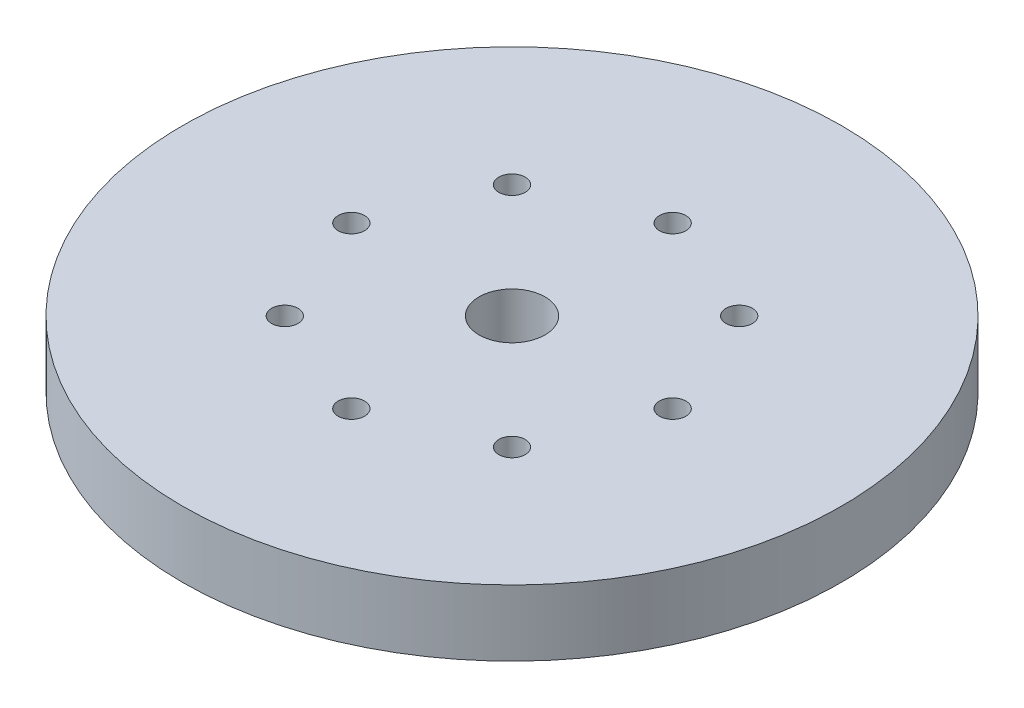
ISO-10303-21;
HEADER;
FILE_DESCRIPTION(('STEP AP214'),'2;1');
FILE_NAME('part.step','',(''),(''),'','','');
FILE_SCHEMA(('AUTOMOTIVE_DESIGN { 1 0 10303 214 1 1 1 1 }'));
ENDSEC;
DATA;
#1=APPLICATION_CONTEXT('core data for automotive mechanical design processes');
#2=APPLICATION_PROTOCOL_DEFINITION('international standard','automotive_design',2000,#1);
#3=PRODUCT_CONTEXT('',#1,'mechanical');
#4=PRODUCT('Part','Part','',(#3));
#5=PRODUCT_RELATED_PRODUCT_CATEGORY('part','',(#4));
#6=PRODUCT_DEFINITION_FORMATION('','',#4);
#7=PRODUCT_DEFINITION_CONTEXT('part definition',#1,'design');
#8=PRODUCT_DEFINITION('design','',#6,#7);
#9=PRODUCT_DEFINITION_SHAPE('','',#8);
#10=(LENGTH_UNIT() NAMED_UNIT(*) SI_UNIT(.MILLI.,.METRE.));
#11=(NAMED_UNIT(*) PLANE_ANGLE_UNIT() SI_UNIT($,.RADIAN.));
#12=(NAMED_UNIT(*) SI_UNIT($,.STERADIAN.) SOLID_ANGLE_UNIT());
#13=UNCERTAINTY_MEASURE_WITH_UNIT(LENGTH_MEASURE(1.E-05),#10,'distance_accuracy_value','');
#14=(GEOMETRIC_REPRESENTATION_CONTEXT(3) GLOBAL_UNCERTAINTY_ASSIGNED_CONTEXT((#13)) GLOBAL_UNIT_ASSIGNED_CONTEXT((#10,
#11,#12)) REPRESENTATION_CONTEXT('',''));
#15=CARTESIAN_POINT('',(0.,0.,0.));
#16=DIRECTION('',(0.,0.,1.));
#17=DIRECTION('',(1.,0.,0.));
#18=AXIS2_PLACEMENT_3D('',#15,#16,#17);
#19=CARTESIAN_POINT('',(0.,6.,0.));
#20=DIRECTION('',(0.,1.,0.));
#21=DIRECTION('',(0.,0.,1.));
#22=AXIS2_PLACEMENT_3D('',#19,#20,#21);
#23=PLANE('',#22);
#24=CARTESIAN_POINT('',(-10.3237590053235,6.,-10.3237590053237));
#25=DIRECTION('',(0.,1.,0.));
#26=DIRECTION('',(0.707106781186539,0.,0.707106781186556));
#27=AXIS2_PLACEMENT_3D('',#24,#25,#26);
#28=CIRCLE('',#27,1.2);
#29=CARTESIAN_POINT('',(-9.47523086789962,6.,-9.47523086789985));
#30=VERTEX_POINT('',#29);
#31=EDGE_CURVE('E415',#30,#30,#28,.T.);
#32=ORIENTED_EDGE('',*,*,#31,.F.);
#33=EDGE_LOOP('',(#32));
#34=FACE_BOUND('',#33,.T.);
#35=CARTESIAN_POINT('',(-14.6,6.,-1.52926971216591E-13));
#36=DIRECTION('',(0.,1.,0.));
#37=DIRECTION('',(1.,0.,0.));
#38=AXIS2_PLACEMENT_3D('',#35,#36,#37);
#39=CIRCLE('',#38,1.2);
#40=CARTESIAN_POINT('',(-13.4,6.,-1.40357631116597E-13));
#41=VERTEX_POINT('',#40);
#42=EDGE_CURVE('E409',#41,#41,#39,.T.);
#43=ORIENTED_EDGE('',*,*,#42,.F.);
#44=EDGE_LOOP('',(#43));
#45=FACE_BOUND('',#44,.T.);
#46=CARTESIAN_POINT('',(-10.3237590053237,6.,10.3237590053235));
#47=DIRECTION('',(0.,1.,0.));
#48=DIRECTION('',(0.707106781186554,0.,-0.707106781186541));
#49=AXIS2_PLACEMENT_3D('',#46,#47,#48);
#50=CIRCLE('',#49,1.2);
#51=CARTESIAN_POINT('',(-9.47523086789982,6.,9.47523086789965));
#52=VERTEX_POINT('',#51);
#53=EDGE_CURVE('E403',#52,#52,#50,.T.);
#54=ORIENTED_EDGE('',*,*,#53,.F.);
#55=EDGE_LOOP('',(#54));
#56=FACE_BOUND('',#55,.T.);
#57=CARTESIAN_POINT('',(-1.01951314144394E-13,6.,14.6));
#58=DIRECTION('',(0.,1.,0.));
#59=DIRECTION('',(0.,0.,-1.));
#60=AXIS2_PLACEMENT_3D('',#57,#58,#59);
#61=CIRCLE('',#60,1.2);
#62=CARTESIAN_POINT('',(0.,6.,13.4));
#63=VERTEX_POINT('',#62);
#64=EDGE_CURVE('E397',#63,#63,#61,.T.);
#65=ORIENTED_EDGE('',*,*,#64,.F.);
#66=EDGE_LOOP('',(#65));
#67=FACE_BOUND('',#66,.T.);
#68=CARTESIAN_POINT('',(10.3237590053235,6.,10.3237590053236));
#69=DIRECTION('',(0.,1.,0.));
#70=DIRECTION('',(-0.707106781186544,0.,-0.707106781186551));
#71=AXIS2_PLACEMENT_3D('',#68,#69,#70);
#72=CIRCLE('',#71,1.2);
#73=CARTESIAN_POINT('',(9.47523086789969,6.,9.47523086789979));
#74=VERTEX_POINT('',#73);
#75=EDGE_CURVE('E391',#74,#74,#72,.T.);
#76=ORIENTED_EDGE('',*,*,#75,.F.);
#77=EDGE_LOOP('',(#76));
#78=FACE_BOUND('',#77,.T.);
#79=CARTESIAN_POINT('',(14.6,6.,0.));
#80=DIRECTION('',(0.,1.,0.));
#81=DIRECTION('',(-1.,0.,0.));
#82=AXIS2_PLACEMENT_3D('',#79,#80,#81);
#83=CIRCLE('',#82,1.2);
#84=CARTESIAN_POINT('',(13.4,6.,0.));
#85=VERTEX_POINT('',#84);
#86=EDGE_CURVE('E385',#85,#85,#83,.T.);
#87=ORIENTED_EDGE('',*,*,#86,.F.);
#88=EDGE_LOOP('',(#87));
#89=FACE_BOUND('',#88,.T.);
#90=CARTESIAN_POINT('',(10.3237590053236,6.,-10.3237590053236));
#91=DIRECTION('',(0.,1.,0.));
#92=DIRECTION('',(-0.707106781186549,0.,0.707106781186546));
#93=AXIS2_PLACEMENT_3D('',#90,#91,#92);
#94=CIRCLE('',#93,1.2);
#95=CARTESIAN_POINT('',(9.47523086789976,6.,-9.47523086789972));
#96=VERTEX_POINT('',#95);
#97=EDGE_CURVE('E379',#96,#96,#94,.T.);
#98=ORIENTED_EDGE('',*,*,#97,.F.);
#99=EDGE_LOOP('',(#98));
#100=FACE_BOUND('',#99,.T.);
#101=CARTESIAN_POINT('',(0.,6.,-14.6));
#102=DIRECTION('',(0.,1.,0.));
#103=DIRECTION('',(0.,0.,1.));
#104=AXIS2_PLACEMENT_3D('',#101,#102,#103);
#105=CIRCLE('',#104,1.2);
#106=CARTESIAN_POINT('',(0.,6.,-13.4));
#107=VERTEX_POINT('',#106);
#108=EDGE_CURVE('E373',#107,#107,#105,.T.);
#109=ORIENTED_EDGE('',*,*,#108,.F.);
#110=EDGE_LOOP('',(#109));
#111=FACE_BOUND('',#110,.T.);
#112=CARTESIAN_POINT('',(0.,6.,0.));
#113=DIRECTION('',(0.,1.,0.));
#114=DIRECTION('',(0.,0.,1.));
#115=AXIS2_PLACEMENT_3D('',#112,#113,#114);
#116=CIRCLE('',#115,29.95);
#117=CARTESIAN_POINT('',(0.,6.,29.95));
#118=VERTEX_POINT('',#117);
#119=EDGE_CURVE('E10',#118,#118,#116,.T.);
#120=ORIENTED_EDGE('',*,*,#119,.T.);
#121=EDGE_LOOP('',(#120));
#122=FACE_BOUND('',#121,.T.);
#123=CARTESIAN_POINT('',(0.,6.,0.));
#124=DIRECTION('',(0.,1.,0.));
#125=DIRECTION('',(0.,0.,1.));
#126=AXIS2_PLACEMENT_3D('',#123,#124,#125);
#127=CIRCLE('',#126,3.);
#128=CARTESIAN_POINT('',(0.,6.,3.));
#129=VERTEX_POINT('',#128);
#130=EDGE_CURVE('E361',#129,#129,#127,.T.);
#131=ORIENTED_EDGE('',*,*,#130,.F.);
#132=EDGE_LOOP('',(#131));
#133=FACE_BOUND('',#132,.T.);
#134=ADVANCED_FACE('F350',(#34,#45,#56,#67,#78,#89,#100,#111,#122,#133),#23,.T.);
#135=CARTESIAN_POINT('',(0.,0.,0.));
#136=DIRECTION('',(0.,1.,0.));
#137=DIRECTION('',(0.,0.,1.));
#138=AXIS2_PLACEMENT_3D('',#135,#136,#137);
#139=PLANE('',#138);
#140=CARTESIAN_POINT('',(-10.3237590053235,0.,-10.3237590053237));
#141=DIRECTION('',(0.,1.,0.));
#142=DIRECTION('',(0.707106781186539,0.,0.707106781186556));
#143=AXIS2_PLACEMENT_3D('',#140,#141,#142);
#144=CIRCLE('',#143,1.2);
#145=CARTESIAN_POINT('',(-9.47523086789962,0.,-9.47523086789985));
#146=VERTEX_POINT('',#145);
#147=EDGE_CURVE('E412',#146,#146,#144,.T.);
#148=ORIENTED_EDGE('',*,*,#147,.T.);
#149=EDGE_LOOP('',(#148));
#150=FACE_BOUND('',#149,.T.);
#151=CARTESIAN_POINT('',(-14.6,0.,-1.52926971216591E-13));
#152=DIRECTION('',(0.,1.,0.));
#153=DIRECTION('',(1.,0.,0.));
#154=AXIS2_PLACEMENT_3D('',#151,#152,#153);
#155=CIRCLE('',#154,1.2);
#156=CARTESIAN_POINT('',(-13.4,0.,-1.40357631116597E-13));
#157=VERTEX_POINT('',#156);
#158=EDGE_CURVE('E406',#157,#157,#155,.T.);
#159=ORIENTED_EDGE('',*,*,#158,.T.);
#160=EDGE_LOOP('',(#159));
#161=FACE_BOUND('',#160,.T.);
#162=CARTESIAN_POINT('',(-10.3237590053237,0.,10.3237590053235));
#163=DIRECTION('',(0.,1.,0.));
#164=DIRECTION('',(0.707106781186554,0.,-0.707106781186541));
#165=AXIS2_PLACEMENT_3D('',#162,#163,#164);
#166=CIRCLE('',#165,1.2);
#167=CARTESIAN_POINT('',(-9.47523086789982,0.,9.47523086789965));
#168=VERTEX_POINT('',#167);
#169=EDGE_CURVE('E400',#168,#168,#166,.T.);
#170=ORIENTED_EDGE('',*,*,#169,.T.);
#171=EDGE_LOOP('',(#170));
#172=FACE_BOUND('',#171,.T.);
#173=CARTESIAN_POINT('',(-1.01951314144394E-13,0.,14.6));
#174=DIRECTION('',(0.,1.,0.));
#175=DIRECTION('',(0.,0.,-1.));
#176=AXIS2_PLACEMENT_3D('',#173,#174,#175);
#177=CIRCLE('',#176,1.2);
#178=CARTESIAN_POINT('',(0.,0.,13.4));
#179=VERTEX_POINT('',#178);
#180=EDGE_CURVE('E394',#179,#179,#177,.T.);
#181=ORIENTED_EDGE('',*,*,#180,.T.);
#182=EDGE_LOOP('',(#181));
#183=FACE_BOUND('',#182,.T.);
#184=CARTESIAN_POINT('',(10.3237590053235,0.,10.3237590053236));
#185=DIRECTION('',(0.,1.,0.));
#186=DIRECTION('',(-0.707106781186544,0.,-0.707106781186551));
#187=AXIS2_PLACEMENT_3D('',#184,#185,#186);
#188=CIRCLE('',#187,1.2);
#189=CARTESIAN_POINT('',(9.47523086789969,0.,9.47523086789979));
#190=VERTEX_POINT('',#189);
#191=EDGE_CURVE('E388',#190,#190,#188,.T.);
#192=ORIENTED_EDGE('',*,*,#191,.T.);
#193=EDGE_LOOP('',(#192));
#194=FACE_BOUND('',#193,.T.);
#195=CARTESIAN_POINT('',(14.6,0.,0.));
#196=DIRECTION('',(0.,1.,0.));
#197=DIRECTION('',(-1.,0.,0.));
#198=AXIS2_PLACEMENT_3D('',#195,#196,#197);
#199=CIRCLE('',#198,1.2);
#200=CARTESIAN_POINT('',(13.4,0.,0.));
#201=VERTEX_POINT('',#200);
#202=EDGE_CURVE('E382',#201,#201,#199,.T.);
#203=ORIENTED_EDGE('',*,*,#202,.T.);
#204=EDGE_LOOP('',(#203));
#205=FACE_BOUND('',#204,.T.);
#206=CARTESIAN_POINT('',(10.3237590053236,0.,-10.3237590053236));
#207=DIRECTION('',(0.,1.,0.));
#208=DIRECTION('',(-0.707106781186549,0.,0.707106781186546));
#209=AXIS2_PLACEMENT_3D('',#206,#207,#208);
#210=CIRCLE('',#209,1.2);
#211=CARTESIAN_POINT('',(9.47523086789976,0.,-9.47523086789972));
#212=VERTEX_POINT('',#211);
#213=EDGE_CURVE('E376',#212,#212,#210,.T.);
#214=ORIENTED_EDGE('',*,*,#213,.T.);
#215=EDGE_LOOP('',(#214));
#216=FACE_BOUND('',#215,.T.);
#217=CARTESIAN_POINT('',(0.,0.,-14.6));
#218=DIRECTION('',(0.,1.,0.));
#219=DIRECTION('',(0.,0.,1.));
#220=AXIS2_PLACEMENT_3D('',#217,#218,#219);
#221=CIRCLE('',#220,1.2);
#222=CARTESIAN_POINT('',(0.,0.,-13.4));
#223=VERTEX_POINT('',#222);
#224=EDGE_CURVE('E370',#223,#223,#221,.T.);
#225=ORIENTED_EDGE('',*,*,#224,.T.);
#226=EDGE_LOOP('',(#225));
#227=FACE_BOUND('',#226,.T.);
#228=CARTESIAN_POINT('',(0.,0.,0.));
#229=DIRECTION('',(0.,1.,0.));
#230=DIRECTION('',(0.,0.,1.));
#231=AXIS2_PLACEMENT_3D('',#228,#229,#230);
#232=CIRCLE('',#231,29.95);
#233=CARTESIAN_POINT('',(0.,0.,29.95));
#234=VERTEX_POINT('',#233);
#235=EDGE_CURVE('E357',#234,#234,#232,.T.);
#236=ORIENTED_EDGE('',*,*,#235,.F.);
#237=EDGE_LOOP('',(#236));
#238=FACE_BOUND('',#237,.T.);
#239=CARTESIAN_POINT('',(0.,0.,0.));
#240=DIRECTION('',(0.,1.,0.));
#241=DIRECTION('',(0.,0.,1.));
#242=AXIS2_PLACEMENT_3D('',#239,#240,#241);
#243=CIRCLE('',#242,3.);
#244=CARTESIAN_POINT('',(0.,0.,3.));
#245=VERTEX_POINT('',#244);
#246=EDGE_CURVE('E365',#245,#245,#243,.T.);
#247=ORIENTED_EDGE('',*,*,#246,.T.);
#248=EDGE_LOOP('',(#247));
#249=FACE_BOUND('',#248,.T.);
#250=ADVANCED_FACE('F423',(#150,#161,#172,#183,#194,#205,#216,#227,#238,#249),#139,.F.);
#251=CARTESIAN_POINT('',(0.,6.,0.));
#252=DIRECTION('',(0.,-1.,0.));
#253=DIRECTION('',(0.,0.,-1.));
#254=AXIS2_PLACEMENT_3D('',#251,#252,#253);
#255=CYLINDRICAL_SURFACE('',#254,29.95);
#256=ORIENTED_EDGE('',*,*,#119,.F.);
#257=EDGE_LOOP('',(#256));
#258=FACE_BOUND('',#257,.T.);
#259=ORIENTED_EDGE('',*,*,#235,.T.);
#260=EDGE_LOOP('',(#259));
#261=FACE_BOUND('',#260,.T.);
#262=ADVANCED_FACE('F352',(#258,#261),#255,.T.);
#263=CARTESIAN_POINT('',(0.,6.,0.));
#264=DIRECTION('',(0.,-1.,0.));
#265=DIRECTION('',(0.,0.,-1.));
#266=AXIS2_PLACEMENT_3D('',#263,#264,#265);
#267=CYLINDRICAL_SURFACE('',#266,3.);
#268=ORIENTED_EDGE('',*,*,#130,.T.);
#269=EDGE_LOOP('',(#268));
#270=FACE_BOUND('',#269,.T.);
#271=ORIENTED_EDGE('',*,*,#246,.F.);
#272=EDGE_LOOP('',(#271));
#273=FACE_BOUND('',#272,.T.);
#274=ADVANCED_FACE('F440',(#270,#273),#267,.F.);
#275=CARTESIAN_POINT('',(0.,0.,-14.6));
#276=DIRECTION('',(0.,1.,0.));
#277=DIRECTION('',(0.,0.,1.));
#278=AXIS2_PLACEMENT_3D('',#275,#276,#277);
#279=CYLINDRICAL_SURFACE('',#278,1.2);
#280=ORIENTED_EDGE('',*,*,#224,.F.);
#281=EDGE_LOOP('',(#280));
#282=FACE_BOUND('',#281,.T.);
#283=ORIENTED_EDGE('',*,*,#108,.T.);
#284=EDGE_LOOP('',(#283));
#285=FACE_BOUND('',#284,.T.);
#286=ADVANCED_FACE('F443',(#282,#285),#279,.F.);
#287=CARTESIAN_POINT('',(10.3237590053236,0.,-10.3237590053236));
#288=DIRECTION('',(0.,1.,0.));
#289=DIRECTION('',(0.,0.,1.));
#290=AXIS2_PLACEMENT_3D('',#287,#288,#289);
#291=CYLINDRICAL_SURFACE('',#290,1.2);
#292=ORIENTED_EDGE('',*,*,#213,.F.);
#293=EDGE_LOOP('',(#292));
#294=FACE_BOUND('',#293,.T.);
#295=ORIENTED_EDGE('',*,*,#97,.T.);
#296=EDGE_LOOP('',(#295));
#297=FACE_BOUND('',#296,.T.);
#298=ADVANCED_FACE('F459',(#294,#297),#291,.F.);
#299=CARTESIAN_POINT('',(14.6,0.,0.));
#300=DIRECTION('',(0.,1.,0.));
#301=DIRECTION('',(0.,0.,1.));
#302=AXIS2_PLACEMENT_3D('',#299,#300,#301);
#303=CYLINDRICAL_SURFACE('',#302,1.2);
#304=ORIENTED_EDGE('',*,*,#202,.F.);
#305=EDGE_LOOP('',(#304));
#306=FACE_BOUND('',#305,.T.);
#307=ORIENTED_EDGE('',*,*,#86,.T.);
#308=EDGE_LOOP('',(#307));
#309=FACE_BOUND('',#308,.T.);
#310=ADVANCED_FACE('F462',(#306,#309),#303,.F.);
#311=CARTESIAN_POINT('',(10.3237590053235,0.,10.3237590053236));
#312=DIRECTION('',(0.,1.,0.));
#313=DIRECTION('',(0.,0.,1.));
#314=AXIS2_PLACEMENT_3D('',#311,#312,#313);
#315=CYLINDRICAL_SURFACE('',#314,1.2);
#316=ORIENTED_EDGE('',*,*,#191,.F.);
#317=EDGE_LOOP('',(#316));
#318=FACE_BOUND('',#317,.T.);
#319=ORIENTED_EDGE('',*,*,#75,.T.);
#320=EDGE_LOOP('',(#319));
#321=FACE_BOUND('',#320,.T.);
#322=ADVANCED_FACE('F466',(#318,#321),#315,.F.);
#323=CARTESIAN_POINT('',(-1.01951314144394E-13,0.,14.6));
#324=DIRECTION('',(0.,1.,0.));
#325=DIRECTION('',(0.,0.,1.));
#326=AXIS2_PLACEMENT_3D('',#323,#324,#325);
#327=CYLINDRICAL_SURFACE('',#326,1.2);
#328=ORIENTED_EDGE('',*,*,#180,.F.);
#329=EDGE_LOOP('',(#328));
#330=FACE_BOUND('',#329,.T.);
#331=ORIENTED_EDGE('',*,*,#64,.T.);
#332=EDGE_LOOP('',(#331));
#333=FACE_BOUND('',#332,.T.);
#334=ADVANCED_FACE('F470',(#330,#333),#327,.F.);
#335=CARTESIAN_POINT('',(-10.3237590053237,0.,10.3237590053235));
#336=DIRECTION('',(0.,1.,0.));
#337=DIRECTION('',(0.,0.,1.));
#338=AXIS2_PLACEMENT_3D('',#335,#336,#337);
#339=CYLINDRICAL_SURFACE('',#338,1.2);
#340=ORIENTED_EDGE('',*,*,#169,.F.);
#341=EDGE_LOOP('',(#340));
#342=FACE_BOUND('',#341,.T.);
#343=ORIENTED_EDGE('',*,*,#53,.T.);
#344=EDGE_LOOP('',(#343));
#345=FACE_BOUND('',#344,.T.);
#346=ADVANCED_FACE('F474',(#342,#345),#339,.F.);
#347=CARTESIAN_POINT('',(-14.6,0.,-1.52926971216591E-13));
#348=DIRECTION('',(0.,1.,0.));
#349=DIRECTION('',(0.,0.,1.));
#350=AXIS2_PLACEMENT_3D('',#347,#348,#349);
#351=CYLINDRICAL_SURFACE('',#350,1.2);
#352=ORIENTED_EDGE('',*,*,#158,.F.);
#353=EDGE_LOOP('',(#352));
#354=FACE_BOUND('',#353,.T.);
#355=ORIENTED_EDGE('',*,*,#42,.T.);
#356=EDGE_LOOP('',(#355));
#357=FACE_BOUND('',#356,.T.);
#358=ADVANCED_FACE('F478',(#354,#357),#351,.F.);
#359=CARTESIAN_POINT('',(-10.3237590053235,0.,-10.3237590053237));
#360=DIRECTION('',(0.,1.,0.));
#361=DIRECTION('',(0.,0.,1.));
#362=AXIS2_PLACEMENT_3D('',#359,#360,#361);
#363=CYLINDRICAL_SURFACE('',#362,1.2);
#364=ORIENTED_EDGE('',*,*,#147,.F.);
#365=EDGE_LOOP('',(#364));
#366=FACE_BOUND('',#365,.T.);
#367=ORIENTED_EDGE('',*,*,#31,.T.);
#368=EDGE_LOOP('',(#367));
#369=FACE_BOUND('',#368,.T.);
#370=ADVANCED_FACE('F419',(#366,#369),#363,.F.);
#371=CLOSED_SHELL('',(#134,#250,#262,#274,#286,#298,#310,#322,#334,#346,#358,#370));
#372=MANIFOLD_SOLID_BREP('B2',#371);
#373=ADVANCED_BREP_SHAPE_REPRESENTATION('',(#18,#372),#14);
#374=SHAPE_DEFINITION_REPRESENTATION(#9,#373);
ENDSEC;
END-ISO-10303-21;
